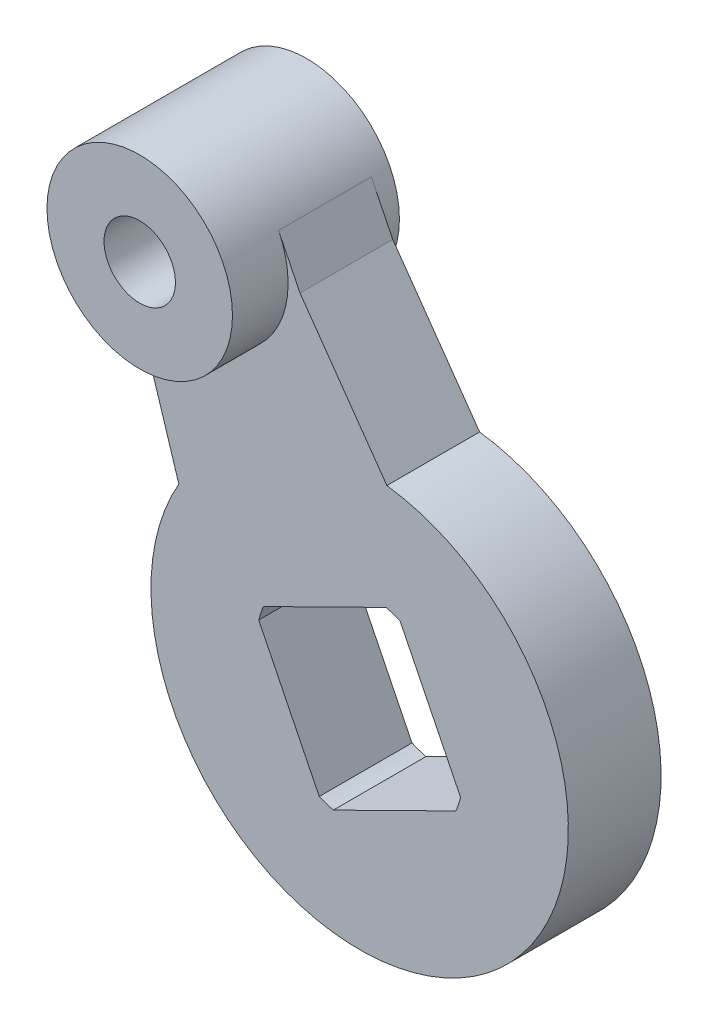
ISO-10303-21;
HEADER;
FILE_DESCRIPTION(('STEP AP214'),'2;1');
FILE_NAME('part.step','',(''),(''),'','','');
FILE_SCHEMA(('AUTOMOTIVE_DESIGN { 1 0 10303 214 1 1 1 1 }'));
ENDSEC;
DATA;
#1=APPLICATION_CONTEXT('core data for automotive mechanical design processes');
#2=APPLICATION_PROTOCOL_DEFINITION('international standard','automotive_design',2000,#1);
#3=PRODUCT_CONTEXT('',#1,'mechanical');
#4=PRODUCT('Part','Part','',(#3));
#5=PRODUCT_RELATED_PRODUCT_CATEGORY('part','',(#4));
#6=PRODUCT_DEFINITION_FORMATION('','',#4);
#7=PRODUCT_DEFINITION_CONTEXT('part definition',#1,'design');
#8=PRODUCT_DEFINITION('design','',#6,#7);
#9=PRODUCT_DEFINITION_SHAPE('','',#8);
#10=(LENGTH_UNIT() NAMED_UNIT(*) SI_UNIT(.MILLI.,.METRE.));
#11=(NAMED_UNIT(*) PLANE_ANGLE_UNIT() SI_UNIT($,.RADIAN.));
#12=(NAMED_UNIT(*) SI_UNIT($,.STERADIAN.) SOLID_ANGLE_UNIT());
#13=UNCERTAINTY_MEASURE_WITH_UNIT(LENGTH_MEASURE(1.E-05),#10,'distance_accuracy_value','');
#14=(GEOMETRIC_REPRESENTATION_CONTEXT(3) GLOBAL_UNCERTAINTY_ASSIGNED_CONTEXT((#13)) GLOBAL_UNIT_ASSIGNED_CONTEXT((#10,
#11,#12)) REPRESENTATION_CONTEXT('',''));
#15=CARTESIAN_POINT('',(0.,0.,0.));
#16=DIRECTION('',(0.,0.,1.));
#17=DIRECTION('',(1.,0.,0.));
#18=AXIS2_PLACEMENT_3D('',#15,#16,#17);
#19=CARTESIAN_POINT('',(-1.771236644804,3.586463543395,-0.6));
#20=DIRECTION('',(0.,0.,-1.));
#21=DIRECTION('',(-1.,0.,0.));
#22=AXIS2_PLACEMENT_3D('',#19,#20,#21);
#23=CYLINDRICAL_SURFACE('',#22,0.385000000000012);
#24=CARTESIAN_POINT('',(-1.771236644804,3.586463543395,-2.4));
#25=DIRECTION('',(0.,0.,-1.));
#26=DIRECTION('',(-1.,0.,0.));
#27=AXIS2_PLACEMENT_3D('',#24,#25,#26);
#28=CIRCLE('',#27,0.385000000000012);
#29=CARTESIAN_POINT('',(-2.15623664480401,3.586463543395,-2.4));
#30=VERTEX_POINT('',#29);
#31=EDGE_CURVE('E20',#30,#30,#28,.T.);
#32=ORIENTED_EDGE('',*,*,#31,.T.);
#33=EDGE_LOOP('',(#32));
#34=FACE_BOUND('',#33,.T.);
#35=CARTESIAN_POINT('',(-1.771236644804,3.586463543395,-0.6));
#36=DIRECTION('',(0.,0.,-1.));
#37=DIRECTION('',(-1.,0.,0.));
#38=AXIS2_PLACEMENT_3D('',#35,#36,#37);
#39=CIRCLE('',#38,0.385000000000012);
#40=CARTESIAN_POINT('',(-2.15623664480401,3.586463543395,-0.6));
#41=VERTEX_POINT('',#40);
#42=EDGE_CURVE('E235',#41,#41,#39,.F.);
#43=ORIENTED_EDGE('',*,*,#42,.T.);
#44=EDGE_LOOP('',(#43));
#45=FACE_BOUND('',#44,.T.);
#46=ADVANCED_FACE('F16',(#34,#45),#23,.F.);
#47=CARTESIAN_POINT('',(-1.528404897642,1.920448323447,-2.6));
#48=DIRECTION('',(0.,0.,1.));
#49=DIRECTION('',(0.442809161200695,-0.896615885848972,0.));
#50=AXIS2_PLACEMENT_3D('',#47,#48,#49);
#51=PLANE('',#50);
#52=CARTESIAN_POINT('',(0.,0.,-2.6));
#53=DIRECTION('',(0.,0.,1.));
#54=DIRECTION('',(1.,0.,0.));
#55=AXIS2_PLACEMENT_3D('',#52,#53,#54);
#56=CIRCLE('',#55,1.30000000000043);
#57=CARTESIAN_POINT('',(-0.0830630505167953,1.29734364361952,-2.6));
#58=VERTEX_POINT('',#57);
#59=CARTESIAN_POINT('',(-0.979678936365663,0.85453448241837,-2.6));
#60=VERTEX_POINT('',#59);
#61=EDGE_CURVE('E231',#58,#60,#56,.T.);
#62=ORIENTED_EDGE('',*,*,#61,.T.);
#63=DIRECTION('',(0.442809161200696,-0.896615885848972,0.));
#64=VECTOR('',#63,1.);
#65=CARTESIAN_POINT('',(-1.2398718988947,1.3813825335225,-2.6));
#66=LINE('',#65,#64);
#67=CARTESIAN_POINT('',(-1.50006486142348,1.9082305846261,-2.6));
#68=VERTEX_POINT('',#67);
#69=EDGE_CURVE('E169',#60,#68,#66,.F.);
#70=ORIENTED_EDGE('',*,*,#69,.T.);
#71=CARTESIAN_POINT('',(-1.771236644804,3.586463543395,-2.6));
#72=DIRECTION('',(0.,0.,1.));
#73=DIRECTION('',(1.,0.,0.));
#74=AXIS2_PLACEMENT_3D('',#71,#72,#73);
#75=CIRCLE('',#74,1.70000000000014);
#76=CARTESIAN_POINT('',(-0.603448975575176,2.35103974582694,-2.6));
#77=VERTEX_POINT('',#76);
#78=EDGE_CURVE('E234',#68,#77,#75,.T.);
#79=ORIENTED_EDGE('',*,*,#78,.T.);
#80=DIRECTION('',(-0.442809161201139,0.896615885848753,0.));
#81=VECTOR('',#80,1.);
#82=CARTESIAN_POINT('',(-0.34325601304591,1.824191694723,-2.6));
#83=LINE('',#82,#81);
#84=EDGE_CURVE('E178',#77,#58,#83,.F.);
#85=ORIENTED_EDGE('',*,*,#84,.T.);
#86=EDGE_LOOP('',(#62,#70,#79,#85));
#87=FACE_BOUND('',#86,.T.);
#88=ADVANCED_FACE('F247',(#87),#51,.F.);
#89=CARTESIAN_POINT('',(-0.3770742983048,3.115077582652,-2.4));
#90=DIRECTION('',(0.,0.,1.));
#91=DIRECTION('',(-0.442809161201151,0.896615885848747,0.));
#92=AXIS2_PLACEMENT_3D('',#89,#90,#91);
#93=PLANE('',#92);
#94=ORIENTED_EDGE('',*,*,#31,.F.);
#95=EDGE_LOOP('',(#94));
#96=FACE_BOUND('',#95,.T.);
#97=CARTESIAN_POINT('',(-1.771236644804,3.586463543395,-2.4));
#98=DIRECTION('',(0.,0.,1.));
#99=DIRECTION('',(1.,0.,0.));
#100=AXIS2_PLACEMENT_3D('',#97,#98,#99);
#101=CIRCLE('',#100,1.00000000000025);
#102=CARTESIAN_POINT('',(-0.77123664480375,3.586463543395,-2.4));
#103=VERTEX_POINT('',#102);
#104=EDGE_CURVE('E164',#103,#103,#101,.F.);
#105=ORIENTED_EDGE('',*,*,#104,.T.);
#106=EDGE_LOOP('',(#105));
#107=FACE_BOUND('',#106,.T.);
#108=ADVANCED_FACE('F243',(#96,#107),#93,.F.);
#109=CARTESIAN_POINT('',(-0.3770742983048,3.115077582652,-0.6));
#110=DIRECTION('',(0.,0.,1.));
#111=DIRECTION('',(-0.442809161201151,0.896615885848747,0.));
#112=AXIS2_PLACEMENT_3D('',#109,#110,#111);
#113=PLANE('',#112);
#114=ORIENTED_EDGE('',*,*,#42,.F.);
#115=EDGE_LOOP('',(#114));
#116=FACE_BOUND('',#115,.T.);
#117=CARTESIAN_POINT('',(-1.771236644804,3.586463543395,-0.6));
#118=DIRECTION('',(0.,0.,1.));
#119=DIRECTION('',(1.,0.,0.));
#120=AXIS2_PLACEMENT_3D('',#117,#118,#119);
#121=CIRCLE('',#120,1.00000000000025);
#122=CARTESIAN_POINT('',(-0.77123664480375,3.586463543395,-0.6));
#123=VERTEX_POINT('',#122);
#124=EDGE_CURVE('E163',#123,#123,#121,.T.);
#125=ORIENTED_EDGE('',*,*,#124,.T.);
#126=EDGE_LOOP('',(#125));
#127=FACE_BOUND('',#126,.T.);
#128=ADVANCED_FACE('F246',(#116,#127),#113,.T.);
#129=CARTESIAN_POINT('',(-1.771236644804,3.586463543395,-2.6));
#130=DIRECTION('',(0.,0.,1.));
#131=DIRECTION('',(1.,0.,0.));
#132=AXIS2_PLACEMENT_3D('',#129,#130,#131);
#133=CYLINDRICAL_SURFACE('',#132,1.70000000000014);
#134=DIRECTION('',(0.,0.,-1.));
#135=VECTOR('',#134,1.);
#136=CARTESIAN_POINT('',(-1.50006486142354,1.90823058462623,-2.4));
#137=LINE('',#136,#135);
#138=CARTESIAN_POINT('',(-1.50006486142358,1.90823058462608,-2.2));
#139=VERTEX_POINT('',#138);
#140=EDGE_CURVE('E233',#68,#139,#137,.F.);
#141=ORIENTED_EDGE('',*,*,#140,.T.);
#142=CARTESIAN_POINT('',(-1.771236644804,3.586463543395,-2.2));
#143=DIRECTION('',(0.,0.,1.));
#144=DIRECTION('',(1.,0.,0.));
#145=AXIS2_PLACEMENT_3D('',#142,#143,#144);
#146=CIRCLE('',#145,1.70000000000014);
#147=CARTESIAN_POINT('',(-0.603448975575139,2.35103974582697,-2.2));
#148=VERTEX_POINT('',#147);
#149=EDGE_CURVE('E150',#139,#148,#146,.T.);
#150=ORIENTED_EDGE('',*,*,#149,.T.);
#151=DIRECTION('',(0.,0.,1.));
#152=VECTOR('',#151,1.);
#153=CARTESIAN_POINT('',(-0.603448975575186,2.35103974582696,-2.4));
#154=LINE('',#153,#152);
#155=EDGE_CURVE('E173',#148,#77,#154,.F.);
#156=ORIENTED_EDGE('',*,*,#155,.T.);
#157=ORIENTED_EDGE('',*,*,#78,.F.);
#158=EDGE_LOOP('',(#141,#150,#156,#157));
#159=FACE_BOUND('',#158,.T.);
#160=ADVANCED_FACE('F361',(#159),#133,.F.);
#161=CARTESIAN_POINT('',(-0.07265533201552,1.276269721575,-2.610519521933));
#162=DIRECTION('',(0.896615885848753,0.442809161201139,0.));
#163=DIRECTION('',(-0.442809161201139,0.896615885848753,0.));
#164=AXIS2_PLACEMENT_3D('',#161,#162,#163);
#165=PLANE('',#164);
#166=DIRECTION('',(0.,0.,1.));
#167=VECTOR('',#166,1.);
#168=CARTESIAN_POINT('',(-0.0830630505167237,1.29734364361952,-2.4));
#169=LINE('',#168,#167);
#170=CARTESIAN_POINT('',(-0.0830630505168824,1.29734364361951,-2.2));
#171=VERTEX_POINT('',#170);
#172=EDGE_CURVE('E179',#171,#58,#169,.F.);
#173=ORIENTED_EDGE('',*,*,#172,.T.);
#174=ORIENTED_EDGE('',*,*,#84,.F.);
#175=ORIENTED_EDGE('',*,*,#155,.F.);
#176=DIRECTION('',(-0.442809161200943,0.89661588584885,0.));
#177=VECTOR('',#176,1.);
#178=CARTESIAN_POINT('',(0.061240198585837,1.00515324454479,-2.2));
#179=LINE('',#178,#177);
#180=EDGE_CURVE('E227',#148,#171,#179,.F.);
#181=ORIENTED_EDGE('',*,*,#180,.T.);
#182=EDGE_LOOP('',(#173,#174,#175,#181));
#183=FACE_BOUND('',#182,.T.);
#184=ADVANCED_FACE('F349',(#183),#165,.T.);
#185=CARTESIAN_POINT('',(0.,0.,-2.6));
#186=DIRECTION('',(0.,0.,1.));
#187=DIRECTION('',(1.,0.,0.));
#188=AXIS2_PLACEMENT_3D('',#185,#186,#187);
#189=CYLINDRICAL_SURFACE('',#188,1.30000000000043);
#190=ORIENTED_EDGE('',*,*,#172,.F.);
#191=CARTESIAN_POINT('',(0.,0.,-2.2));
#192=DIRECTION('',(0.,0.,1.));
#193=DIRECTION('',(1.,0.,0.));
#194=AXIS2_PLACEMENT_3D('',#191,#192,#193);
#195=CIRCLE('',#194,1.30000000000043);
#196=CARTESIAN_POINT('',(-0.979678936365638,0.854534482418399,-2.2));
#197=VERTEX_POINT('',#196);
#198=EDGE_CURVE('E224',#171,#197,#195,.T.);
#199=ORIENTED_EDGE('',*,*,#198,.T.);
#200=DIRECTION('',(0.,0.,1.));
#201=VECTOR('',#200,1.);
#202=CARTESIAN_POINT('',(-0.979678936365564,0.854534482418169,-2.4));
#203=LINE('',#202,#201);
#204=EDGE_CURVE('E177',#197,#60,#203,.F.);
#205=ORIENTED_EDGE('',*,*,#204,.T.);
#206=ORIENTED_EDGE('',*,*,#61,.F.);
#207=EDGE_LOOP('',(#190,#199,#205,#206));
#208=FACE_BOUND('',#207,.T.);
#209=ADVANCED_FACE('F262',(#208),#189,.F.);
#210=CARTESIAN_POINT('',(-1.510472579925,1.929304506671,-2.610519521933));
#211=DIRECTION('',(-0.896615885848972,-0.442809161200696,0.));
#212=DIRECTION('',(0.442809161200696,-0.896615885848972,0.));
#213=AXIS2_PLACEMENT_3D('',#210,#211,#212);
#214=PLANE('',#213);
#215=ORIENTED_EDGE('',*,*,#204,.F.);
#216=DIRECTION('',(0.442809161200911,-0.896615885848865,0.));
#217=VECTOR('',#216,1.);
#218=CARTESIAN_POINT('',(-0.835375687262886,0.562344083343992,-2.2));
#219=LINE('',#218,#217);
#220=EDGE_CURVE('E223',#197,#139,#219,.F.);
#221=ORIENTED_EDGE('',*,*,#220,.T.);
#222=ORIENTED_EDGE('',*,*,#140,.F.);
#223=ORIENTED_EDGE('',*,*,#69,.F.);
#224=EDGE_LOOP('',(#215,#221,#222,#223));
#225=FACE_BOUND('',#224,.T.);
#226=ADVANCED_FACE('F252',(#225),#214,.T.);
#227=CARTESIAN_POINT('',(-1.771236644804,3.586463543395,-2.4));
#228=DIRECTION('',(0.,0.,1.));
#229=DIRECTION('',(1.,0.,0.));
#230=AXIS2_PLACEMENT_3D('',#227,#228,#229);
#231=CYLINDRICAL_SURFACE('',#230,1.00000000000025);
#232=ORIENTED_EDGE('',*,*,#104,.F.);
#233=EDGE_LOOP('',(#232));
#234=FACE_BOUND('',#233,.T.);
#235=DIRECTION('',(0.,0.,1.));
#236=VECTOR('',#235,1.);
#237=CARTESIAN_POINT('',(-0.8746207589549,4.029272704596,-1.5));
#238=LINE('',#237,#236);
#239=CARTESIAN_POINT('',(-0.874620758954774,4.029272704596,-2.2));
#240=VERTEX_POINT('',#239);
#241=CARTESIAN_POINT('',(-0.874620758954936,4.02927270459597,-1.2));
#242=VERTEX_POINT('',#241);
#243=EDGE_CURVE('E156',#240,#242,#238,.T.);
#244=ORIENTED_EDGE('',*,*,#243,.F.);
#245=CARTESIAN_POINT('',(-1.771236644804,3.586463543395,-2.2));
#246=DIRECTION('',(0.,0.,1.));
#247=DIRECTION('',(1.,0.,0.));
#248=AXIS2_PLACEMENT_3D('',#245,#246,#247);
#249=CIRCLE('',#248,1.00000000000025);
#250=CARTESIAN_POINT('',(-2.66785253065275,3.14365438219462,-2.2));
#251=VERTEX_POINT('',#250);
#252=EDGE_CURVE('E143',#240,#251,#249,.F.);
#253=ORIENTED_EDGE('',*,*,#252,.T.);
#254=DIRECTION('',(0.,0.,-1.));
#255=VECTOR('',#254,1.);
#256=CARTESIAN_POINT('',(-2.66785253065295,3.14365438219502,-1.7));
#257=LINE('',#256,#255);
#258=CARTESIAN_POINT('',(-2.66785253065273,3.14365438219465,-1.2));
#259=VERTEX_POINT('',#258);
#260=EDGE_CURVE('E311',#251,#259,#257,.F.);
#261=ORIENTED_EDGE('',*,*,#260,.T.);
#262=CARTESIAN_POINT('',(-1.771236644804,3.586463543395,-1.2));
#263=DIRECTION('',(0.,0.,1.));
#264=DIRECTION('',(1.,0.,0.));
#265=AXIS2_PLACEMENT_3D('',#262,#263,#264);
#266=CIRCLE('',#265,1.00000000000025);
#267=EDGE_CURVE('E136',#242,#259,#266,.F.);
#268=ORIENTED_EDGE('',*,*,#267,.F.);
#269=EDGE_LOOP('',(#244,#253,#261,#268));
#270=FACE_BOUND('',#269,.T.);
#271=ORIENTED_EDGE('',*,*,#124,.F.);
#272=EDGE_LOOP('',(#271));
#273=FACE_BOUND('',#272,.T.);
#274=ADVANCED_FACE('F161',(#234,#270,#273),#231,.T.);
#275=CARTESIAN_POINT('',(-3.925158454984,2.662164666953,-2.2));
#276=DIRECTION('',(0.,0.,-1.));
#277=DIRECTION('',(0.896615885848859,0.442809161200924,0.));
#278=AXIS2_PLACEMENT_3D('',#275,#276,#277);
#279=PLANE('',#278);
#280=DIRECTION('',(0.442809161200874,-0.896615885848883,0.));
#281=VECTOR('',#280,1.);
#282=CARTESIAN_POINT('',(-0.76212350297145,-0.37638778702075,-2.2));
#283=LINE('',#282,#281);
#284=CARTESIAN_POINT('',(-1.08846063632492,0.284391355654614,-2.2));
#285=VERTEX_POINT('',#284);
#286=CARTESIAN_POINT('',(-0.435786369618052,-1.03716692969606,-2.2));
#287=VERTEX_POINT('',#286);
#288=EDGE_CURVE('E302',#285,#287,#283,.T.);
#289=ORIENTED_EDGE('',*,*,#288,.T.);
#290=CARTESIAN_POINT('',(0.,0.,-2.2));
#291=DIRECTION('',(0.,0.,-1.));
#292=DIRECTION('',(-1.,0.,0.));
#293=AXIS2_PLACEMENT_3D('',#290,#291,#292);
#294=CIRCLE('',#293,1.12500000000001);
#295=CARTESIAN_POINT('',(-0.284391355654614,-1.08846063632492,-2.2));
#296=VERTEX_POINT('',#295);
#297=EDGE_CURVE('E208',#287,#296,#294,.F.);
#298=ORIENTED_EDGE('',*,*,#297,.T.);
#299=DIRECTION('',(0.896615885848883,0.442809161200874,0.));
#300=VECTOR('',#299,1.);
#301=CARTESIAN_POINT('',(0.37638778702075,-0.76212350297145,-2.2));
#302=LINE('',#301,#300);
#303=CARTESIAN_POINT('',(1.03716692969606,-0.435786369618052,-2.2));
#304=VERTEX_POINT('',#303);
#305=EDGE_CURVE('E297',#296,#304,#302,.T.);
#306=ORIENTED_EDGE('',*,*,#305,.T.);
#307=CARTESIAN_POINT('',(0.,0.,-2.2));
#308=DIRECTION('',(0.,0.,-1.));
#309=DIRECTION('',(-1.,0.,0.));
#310=AXIS2_PLACEMENT_3D('',#307,#308,#309);
#311=CIRCLE('',#310,1.12500000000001);
#312=CARTESIAN_POINT('',(1.08846063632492,-0.284391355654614,-2.2));
#313=VERTEX_POINT('',#312);
#314=EDGE_CURVE('E204',#304,#313,#311,.F.);
#315=ORIENTED_EDGE('',*,*,#314,.T.);
#316=DIRECTION('',(-0.442809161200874,0.896615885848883,0.));
#317=VECTOR('',#316,1.);
#318=CARTESIAN_POINT('',(0.76212350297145,0.37638778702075,-2.2));
#319=LINE('',#318,#317);
#320=CARTESIAN_POINT('',(0.435786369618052,1.03716692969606,-2.2));
#321=VERTEX_POINT('',#320);
#322=EDGE_CURVE('E292',#313,#321,#319,.T.);
#323=ORIENTED_EDGE('',*,*,#322,.T.);
#324=CARTESIAN_POINT('',(0.,0.,-2.2));
#325=DIRECTION('',(0.,0.,-1.));
#326=DIRECTION('',(-1.,0.,0.));
#327=AXIS2_PLACEMENT_3D('',#324,#325,#326);
#328=CIRCLE('',#327,1.12500000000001);
#329=CARTESIAN_POINT('',(0.284391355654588,1.08846063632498,-2.2));
#330=VERTEX_POINT('',#329);
#331=EDGE_CURVE('E220',#330,#321,#328,.T.);
#332=ORIENTED_EDGE('',*,*,#331,.F.);
#333=DIRECTION('',(-0.896615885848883,-0.442809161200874,0.));
#334=VECTOR('',#333,1.);
#335=CARTESIAN_POINT('',(-0.37638778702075,0.76212350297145,-2.2));
#336=LINE('',#335,#334);
#337=CARTESIAN_POINT('',(-1.03716692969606,0.435786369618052,-2.2));
#338=VERTEX_POINT('',#337);
#339=EDGE_CURVE('E307',#330,#338,#336,.T.);
#340=ORIENTED_EDGE('',*,*,#339,.T.);
#341=CARTESIAN_POINT('',(0.,0.,-2.2));
#342=DIRECTION('',(0.,0.,-1.));
#343=DIRECTION('',(-1.,0.,0.));
#344=AXIS2_PLACEMENT_3D('',#341,#342,#343);
#345=CIRCLE('',#344,1.12500000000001);
#346=EDGE_CURVE('E212',#338,#285,#345,.F.);
#347=ORIENTED_EDGE('',*,*,#346,.T.);
#348=EDGE_LOOP('',(#289,#298,#306,#315,#323,#332,#340,#347));
#349=FACE_BOUND('',#348,.T.);
#350=ORIENTED_EDGE('',*,*,#198,.F.);
#351=ORIENTED_EDGE('',*,*,#180,.F.);
#352=ORIENTED_EDGE('',*,*,#149,.F.);
#353=ORIENTED_EDGE('',*,*,#220,.F.);
#354=EDGE_LOOP('',(#350,#351,#352,#353));
#355=FACE_BOUND('',#354,.T.);
#356=ORIENTED_EDGE('',*,*,#252,.F.);
#357=DIRECTION('',(-0.442809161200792,0.896615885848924,0.));
#358=VECTOR('',#357,1.);
#359=CARTESIAN_POINT('',(-0.75884115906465,3.794838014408,-2.2));
#360=LINE('',#359,#358);
#361=CARTESIAN_POINT('',(-0.643061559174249,3.56040332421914,-2.2));
#362=VERTEX_POINT('',#361);
#363=EDGE_CURVE('E146',#240,#362,#360,.F.);
#364=ORIENTED_EDGE('',*,*,#363,.T.);
#365=DIRECTION('',(-0.575817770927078,0.817578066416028,0.));
#366=VECTOR('',#365,1.);
#367=CARTESIAN_POINT('',(-0.174840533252,2.895597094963,-2.2));
#368=LINE('',#367,#366);
#369=CARTESIAN_POINT('',(0.293380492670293,2.23079086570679,-2.2));
#370=VERTEX_POINT('',#369);
#371=EDGE_CURVE('E222',#362,#370,#368,.F.);
#372=ORIENTED_EDGE('',*,*,#371,.T.);
#373=CARTESIAN_POINT('',(0.,0.,-2.2));
#374=DIRECTION('',(0.,0.,-1.));
#375=DIRECTION('',(-1.,0.,0.));
#376=AXIS2_PLACEMENT_3D('',#373,#374,#375);
#377=CIRCLE('',#376,2.25000000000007);
#378=CARTESIAN_POINT('',(-1.94970900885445,1.12300257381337,-2.2));
#379=VERTEX_POINT('',#378);
#380=EDGE_CURVE('E216',#370,#379,#377,.T.);
#381=ORIENTED_EDGE('',*,*,#380,.T.);
#382=DIRECTION('',(0.299200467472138,-0.954190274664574,0.));
#383=VECTOR('',#382,1.);
#384=CARTESIAN_POINT('',(-2.1930011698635,1.8988937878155,-2.2));
#385=LINE('',#384,#383);
#386=CARTESIAN_POINT('',(-2.43629333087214,2.67478500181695,-2.2));
#387=VERTEX_POINT('',#386);
#388=EDGE_CURVE('E314',#379,#387,#385,.F.);
#389=ORIENTED_EDGE('',*,*,#388,.T.);
#390=DIRECTION('',(0.442809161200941,-0.896615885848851,0.));
#391=VECTOR('',#390,1.);
#392=CARTESIAN_POINT('',(-2.5520729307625,2.909219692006,-2.2));
#393=LINE('',#392,#391);
#394=EDGE_CURVE('E149',#387,#251,#393,.F.);
#395=ORIENTED_EDGE('',*,*,#394,.T.);
#396=EDGE_LOOP('',(#356,#364,#372,#381,#389,#395));
#397=FACE_BOUND('',#396,.T.);
#398=ADVANCED_FACE('F145',(#349,#355,#397),#279,.T.);
#399=CARTESIAN_POINT('',(-0.6617904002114,3.58699557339,-2.22));
#400=DIRECTION('',(0.817578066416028,0.575817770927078,0.));
#401=DIRECTION('',(0.,0.,1.));
#402=AXIS2_PLACEMENT_3D('',#399,#400,#401);
#403=PLANE('',#402);
#404=DIRECTION('',(0.,0.,-1.));
#405=VECTOR('',#404,1.);
#406=CARTESIAN_POINT('',(-0.643061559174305,3.5604033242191,-1.7));
#407=LINE('',#406,#405);
#408=CARTESIAN_POINT('',(-0.643061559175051,3.56040332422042,-1.2));
#409=VERTEX_POINT('',#408);
#410=EDGE_CURVE('E159',#362,#409,#407,.F.);
#411=ORIENTED_EDGE('',*,*,#410,.T.);
#412=DIRECTION('',(0.575817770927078,-0.817578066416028,0.));
#413=VECTOR('',#412,1.);
#414=CARTESIAN_POINT('',(-0.6617904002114,3.58699557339,-1.2));
#415=LINE('',#414,#413);
#416=CARTESIAN_POINT('',(0.293380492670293,2.23079086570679,-1.2));
#417=VERTEX_POINT('',#416);
#418=EDGE_CURVE('E200',#409,#417,#415,.T.);
#419=ORIENTED_EDGE('',*,*,#418,.T.);
#420=DIRECTION('',(0.,0.,-1.));
#421=VECTOR('',#420,1.);
#422=CARTESIAN_POINT('',(0.293380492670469,2.23079086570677,-1.7));
#423=LINE('',#422,#421);
#424=EDGE_CURVE('E219',#417,#370,#423,.T.);
#425=ORIENTED_EDGE('',*,*,#424,.T.);
#426=ORIENTED_EDGE('',*,*,#371,.F.);
#427=EDGE_LOOP('',(#411,#419,#425,#426));
#428=FACE_BOUND('',#427,.T.);
#429=ADVANCED_FACE('F259',(#428),#403,.T.);
#430=CARTESIAN_POINT('',(0.,0.,-1.2));
#431=DIRECTION('',(0.,0.,-1.));
#432=DIRECTION('',(-1.,0.,0.));
#433=AXIS2_PLACEMENT_3D('',#430,#431,#432);
#434=CYLINDRICAL_SURFACE('',#433,2.25000000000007);
#435=DIRECTION('',(0.,0.,1.));
#436=VECTOR('',#435,1.);
#437=CARTESIAN_POINT('',(-1.94970900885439,1.12300257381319,-1.7));
#438=LINE('',#437,#436);
#439=CARTESIAN_POINT('',(-1.94970900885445,1.12300257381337,-1.2));
#440=VERTEX_POINT('',#439);
#441=EDGE_CURVE('E218',#440,#379,#438,.F.);
#442=ORIENTED_EDGE('',*,*,#441,.T.);
#443=ORIENTED_EDGE('',*,*,#380,.F.);
#444=ORIENTED_EDGE('',*,*,#424,.F.);
#445=CARTESIAN_POINT('',(0.,0.,-1.2));
#446=DIRECTION('',(0.,0.,-1.));
#447=DIRECTION('',(-1.,0.,0.));
#448=AXIS2_PLACEMENT_3D('',#445,#446,#447);
#449=CIRCLE('',#448,2.25000000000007);
#450=EDGE_CURVE('E197',#417,#440,#449,.T.);
#451=ORIENTED_EDGE('',*,*,#450,.T.);
#452=EDGE_LOOP('',(#442,#443,#444,#451));
#453=FACE_BOUND('',#452,.T.);
#454=ADVANCED_FACE('F378',(#453),#434,.T.);
#455=CARTESIAN_POINT('',(-1.939977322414,1.091966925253,-2.22));
#456=DIRECTION('',(-0.954190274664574,-0.299200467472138,0.));
#457=DIRECTION('',(0.,0.,1.));
#458=AXIS2_PLACEMENT_3D('',#455,#456,#457);
#459=PLANE('',#458);
#460=DIRECTION('',(0.,0.,1.));
#461=VECTOR('',#460,1.);
#462=CARTESIAN_POINT('',(-2.43629333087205,2.67478500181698,-1.7));
#463=LINE('',#462,#461);
#464=CARTESIAN_POINT('',(-2.43629333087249,2.67478500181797,-1.2));
#465=VERTEX_POINT('',#464);
#466=EDGE_CURVE('E313',#465,#387,#463,.F.);
#467=ORIENTED_EDGE('',*,*,#466,.T.);
#468=ORIENTED_EDGE('',*,*,#388,.F.);
#469=ORIENTED_EDGE('',*,*,#441,.F.);
#470=DIRECTION('',(-0.299200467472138,0.954190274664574,0.));
#471=VECTOR('',#470,1.);
#472=CARTESIAN_POINT('',(-1.939977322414,1.091966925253,-1.2));
#473=LINE('',#472,#471);
#474=EDGE_CURVE('E193',#440,#465,#473,.T.);
#475=ORIENTED_EDGE('',*,*,#474,.T.);
#476=EDGE_LOOP('',(#467,#468,#469,#475));
#477=FACE_BOUND('',#476,.T.);
#478=ADVANCED_FACE('F380',(#477),#459,.T.);
#479=CARTESIAN_POINT('',(-2.672510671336,3.153086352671,-2.22));
#480=DIRECTION('',(-0.896615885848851,-0.442809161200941,0.));
#481=DIRECTION('',(0.442809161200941,-0.896615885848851,0.));
#482=AXIS2_PLACEMENT_3D('',#479,#480,#481);
#483=PLANE('',#482);
#484=ORIENTED_EDGE('',*,*,#466,.F.);
#485=DIRECTION('',(-0.442809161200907,0.896615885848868,0.));
#486=VECTOR('',#485,1.);
#487=CARTESIAN_POINT('',(-1.28368998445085,0.340952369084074,-1.2));
#488=LINE('',#487,#486);
#489=EDGE_CURVE('E196',#465,#259,#488,.T.);
#490=ORIENTED_EDGE('',*,*,#489,.T.);
#491=ORIENTED_EDGE('',*,*,#260,.F.);
#492=ORIENTED_EDGE('',*,*,#394,.F.);
#493=EDGE_LOOP('',(#484,#490,#491,#492));
#494=FACE_BOUND('',#493,.T.);
#495=ADVANCED_FACE('F383',(#494),#483,.T.);
#496=CARTESIAN_POINT('',(-0.6384034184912,3.550971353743,-2.22));
#497=DIRECTION('',(0.896615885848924,0.442809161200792,0.));
#498=DIRECTION('',(-0.442809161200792,0.896615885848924,0.));
#499=AXIS2_PLACEMENT_3D('',#496,#497,#498);
#500=PLANE('',#499);
#501=ORIENTED_EDGE('',*,*,#410,.F.);
#502=ORIENTED_EDGE('',*,*,#363,.F.);
#503=ORIENTED_EDGE('',*,*,#243,.T.);
#504=DIRECTION('',(0.442809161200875,-0.896615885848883,0.));
#505=VECTOR('',#504,1.);
#506=CARTESIAN_POINT('',(0.509541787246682,1.2265706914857,-1.2));
#507=LINE('',#506,#505);
#508=EDGE_CURVE('E279',#242,#409,#507,.T.);
#509=ORIENTED_EDGE('',*,*,#508,.T.);
#510=EDGE_LOOP('',(#501,#502,#503,#509));
#511=FACE_BOUND('',#510,.T.);
#512=ADVANCED_FACE('F154',(#511),#500,.T.);
#513=CARTESIAN_POINT('',(-1.063598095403,0.4227328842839,-1.18));
#514=DIRECTION('',(-0.442809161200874,0.896615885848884,0.));
#515=DIRECTION('',(0.896615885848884,0.442809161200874,0.));
#516=AXIS2_PLACEMENT_3D('',#513,#514,#515);
#517=PLANE('',#516);
#518=ORIENTED_EDGE('',*,*,#339,.F.);
#519=DIRECTION('',(0.,0.,-1.));
#520=VECTOR('',#519,1.);
#521=CARTESIAN_POINT('',(0.2843913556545,1.088460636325,-1.7));
#522=LINE('',#521,#520);
#523=CARTESIAN_POINT('',(0.284391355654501,1.088460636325,-1.2));
#524=VERTEX_POINT('',#523);
#525=EDGE_CURVE('E203',#330,#524,#522,.F.);
#526=ORIENTED_EDGE('',*,*,#525,.T.);
#527=DIRECTION('',(-0.896615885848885,-0.442809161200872,0.));
#528=VECTOR('',#527,1.);
#529=CARTESIAN_POINT('',(-0.376387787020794,0.762123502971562,-1.2));
#530=LINE('',#529,#528);
#531=CARTESIAN_POINT('',(-1.03716692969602,0.435786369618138,-1.2));
#532=VERTEX_POINT('',#531);
#533=EDGE_CURVE('E192',#524,#532,#530,.T.);
#534=ORIENTED_EDGE('',*,*,#533,.T.);
#535=DIRECTION('',(0.,0.,1.));
#536=VECTOR('',#535,1.);
#537=CARTESIAN_POINT('',(-1.03716692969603,0.435786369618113,-1.7));
#538=LINE('',#537,#536);
#539=EDGE_CURVE('E215',#532,#338,#538,.F.);
#540=ORIENTED_EDGE('',*,*,#539,.T.);
#541=EDGE_LOOP('',(#518,#526,#534,#540));
#542=FACE_BOUND('',#541,.T.);
#543=ADVANCED_FACE('F390',(#542),#517,.F.);
#544=CARTESIAN_POINT('',(0.,0.,-1.2));
#545=DIRECTION('',(0.,0.,-1.));
#546=DIRECTION('',(-1.,0.,0.));
#547=AXIS2_PLACEMENT_3D('',#544,#545,#546);
#548=CYLINDRICAL_SURFACE('',#547,1.12500000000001);
#549=ORIENTED_EDGE('',*,*,#346,.F.);
#550=ORIENTED_EDGE('',*,*,#539,.F.);
#551=CARTESIAN_POINT('',(0.,0.,-1.2));
#552=DIRECTION('',(0.,0.,-1.));
#553=DIRECTION('',(-1.,0.,0.));
#554=AXIS2_PLACEMENT_3D('',#551,#552,#553);
#555=CIRCLE('',#554,1.12500000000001);
#556=CARTESIAN_POINT('',(-1.08846063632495,0.284391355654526,-1.2));
#557=VERTEX_POINT('',#556);
#558=EDGE_CURVE('E189',#532,#557,#555,.F.);
#559=ORIENTED_EDGE('',*,*,#558,.T.);
#560=DIRECTION('',(0.,0.,-1.));
#561=VECTOR('',#560,1.);
#562=CARTESIAN_POINT('',(-1.08846063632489,0.284391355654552,-1.7));
#563=LINE('',#562,#561);
#564=EDGE_CURVE('E214',#557,#285,#563,.T.);
#565=ORIENTED_EDGE('',*,*,#564,.T.);
#566=EDGE_LOOP('',(#549,#550,#559,#565));
#567=FACE_BOUND('',#566,.T.);
#568=ADVANCED_FACE('F393',(#567),#548,.F.);
#569=CARTESIAN_POINT('',(-0.4227328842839,-1.063598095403,-1.18));
#570=DIRECTION('',(-0.896615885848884,-0.442809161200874,0.));
#571=DIRECTION('',(-0.442809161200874,0.896615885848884,0.));
#572=AXIS2_PLACEMENT_3D('',#569,#570,#571);
#573=PLANE('',#572);
#574=ORIENTED_EDGE('',*,*,#288,.F.);
#575=ORIENTED_EDGE('',*,*,#564,.F.);
#576=DIRECTION('',(0.442809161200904,-0.896615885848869,0.));
#577=VECTOR('',#576,1.);
#578=CARTESIAN_POINT('',(-1.1491976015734,0.407373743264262,-1.2));
#579=LINE('',#578,#577);
#580=CARTESIAN_POINT('',(-0.4357863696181,-1.03716692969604,-1.2));
#581=VERTEX_POINT('',#580);
#582=EDGE_CURVE('E188',#557,#581,#579,.T.);
#583=ORIENTED_EDGE('',*,*,#582,.T.);
#584=DIRECTION('',(0.,0.,1.));
#585=VECTOR('',#584,1.);
#586=CARTESIAN_POINT('',(-0.435786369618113,-1.03716692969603,-1.7));
#587=LINE('',#586,#585);
#588=EDGE_CURVE('E211',#581,#287,#587,.F.);
#589=ORIENTED_EDGE('',*,*,#588,.T.);
#590=EDGE_LOOP('',(#574,#575,#583,#589));
#591=FACE_BOUND('',#590,.T.);
#592=ADVANCED_FACE('F395',(#591),#573,.F.);
#593=CARTESIAN_POINT('',(0.,0.,-1.2));
#594=DIRECTION('',(0.,0.,-1.));
#595=DIRECTION('',(-1.,0.,0.));
#596=AXIS2_PLACEMENT_3D('',#593,#594,#595);
#597=CYLINDRICAL_SURFACE('',#596,1.12500000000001);
#598=ORIENTED_EDGE('',*,*,#297,.F.);
#599=ORIENTED_EDGE('',*,*,#588,.F.);
#600=CARTESIAN_POINT('',(0.,0.,-1.2));
#601=DIRECTION('',(0.,0.,-1.));
#602=DIRECTION('',(-1.,0.,0.));
#603=AXIS2_PLACEMENT_3D('',#600,#601,#602);
#604=CIRCLE('',#603,1.12500000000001);
#605=CARTESIAN_POINT('',(-0.284391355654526,-1.08846063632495,-1.2));
#606=VERTEX_POINT('',#605);
#607=EDGE_CURVE('E185',#581,#606,#604,.F.);
#608=ORIENTED_EDGE('',*,*,#607,.T.);
#609=DIRECTION('',(0.,0.,-1.));
#610=VECTOR('',#609,1.);
#611=CARTESIAN_POINT('',(-0.284391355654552,-1.08846063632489,-1.7));
#612=LINE('',#611,#610);
#613=EDGE_CURVE('E210',#606,#296,#612,.T.);
#614=ORIENTED_EDGE('',*,*,#613,.T.);
#615=EDGE_LOOP('',(#598,#599,#608,#614));
#616=FACE_BOUND('',#615,.T.);
#617=ADVANCED_FACE('F398',(#616),#597,.F.);
#618=CARTESIAN_POINT('',(1.063598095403,-0.4227328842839,-1.18));
#619=DIRECTION('',(0.442809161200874,-0.896615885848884,0.));
#620=DIRECTION('',(-0.896615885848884,-0.442809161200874,0.));
#621=AXIS2_PLACEMENT_3D('',#618,#619,#620);
#622=PLANE('',#621);
#623=ORIENTED_EDGE('',*,*,#305,.F.);
#624=ORIENTED_EDGE('',*,*,#613,.F.);
#625=DIRECTION('',(0.896615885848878,0.442809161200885,0.));
#626=VECTOR('',#625,1.);
#627=CARTESIAN_POINT('',(0.376387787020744,-0.762123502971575,-1.2));
#628=LINE('',#627,#626);
#629=CARTESIAN_POINT('',(1.03716692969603,-0.435786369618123,-1.2));
#630=VERTEX_POINT('',#629);
#631=EDGE_CURVE('E184',#606,#630,#628,.T.);
#632=ORIENTED_EDGE('',*,*,#631,.T.);
#633=DIRECTION('',(0.,0.,1.));
#634=VECTOR('',#633,1.);
#635=CARTESIAN_POINT('',(1.03716692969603,-0.435786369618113,-1.7));
#636=LINE('',#635,#634);
#637=EDGE_CURVE('E207',#630,#304,#636,.F.);
#638=ORIENTED_EDGE('',*,*,#637,.T.);
#639=EDGE_LOOP('',(#623,#624,#632,#638));
#640=FACE_BOUND('',#639,.T.);
#641=ADVANCED_FACE('F400',(#640),#622,.F.);
#642=CARTESIAN_POINT('',(0.,0.,-1.2));
#643=DIRECTION('',(0.,0.,-1.));
#644=DIRECTION('',(-1.,0.,0.));
#645=AXIS2_PLACEMENT_3D('',#642,#643,#644);
#646=CYLINDRICAL_SURFACE('',#645,1.12500000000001);
#647=ORIENTED_EDGE('',*,*,#314,.F.);
#648=ORIENTED_EDGE('',*,*,#637,.F.);
#649=CARTESIAN_POINT('',(0.,0.,-1.2));
#650=DIRECTION('',(0.,0.,-1.));
#651=DIRECTION('',(-1.,0.,0.));
#652=AXIS2_PLACEMENT_3D('',#649,#650,#651);
#653=CIRCLE('',#652,1.12500000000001);
#654=CARTESIAN_POINT('',(1.08846063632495,-0.284391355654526,-1.2));
#655=VERTEX_POINT('',#654);
#656=EDGE_CURVE('E181',#630,#655,#653,.F.);
#657=ORIENTED_EDGE('',*,*,#656,.T.);
#658=DIRECTION('',(0.,0.,-1.));
#659=VECTOR('',#658,1.);
#660=CARTESIAN_POINT('',(1.08846063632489,-0.284391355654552,-1.7));
#661=LINE('',#660,#659);
#662=EDGE_CURVE('E206',#655,#313,#661,.T.);
#663=ORIENTED_EDGE('',*,*,#662,.T.);
#664=EDGE_LOOP('',(#647,#648,#657,#663));
#665=FACE_BOUND('',#664,.T.);
#666=ADVANCED_FACE('F402',(#665),#646,.F.);
#667=CARTESIAN_POINT('',(0.4227328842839,1.063598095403,-1.18));
#668=DIRECTION('',(0.896615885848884,0.442809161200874,0.));
#669=DIRECTION('',(0.442809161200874,-0.896615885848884,0.));
#670=AXIS2_PLACEMENT_3D('',#667,#668,#669);
#671=PLANE('',#670);
#672=ORIENTED_EDGE('',*,*,#322,.F.);
#673=ORIENTED_EDGE('',*,*,#662,.F.);
#674=DIRECTION('',(-0.442809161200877,0.896615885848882,0.));
#675=VECTOR('',#674,1.);
#676=CARTESIAN_POINT('',(0.375049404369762,1.16014931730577,-1.2));
#677=LINE('',#676,#675);
#678=CARTESIAN_POINT('',(0.435786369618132,1.03716692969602,-1.2));
#679=VERTEX_POINT('',#678);
#680=EDGE_CURVE('E26',#655,#679,#677,.T.);
#681=ORIENTED_EDGE('',*,*,#680,.T.);
#682=DIRECTION('',(0.,0.,1.));
#683=VECTOR('',#682,1.);
#684=CARTESIAN_POINT('',(0.435786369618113,1.03716692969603,-1.7));
#685=LINE('',#684,#683);
#686=EDGE_CURVE('E34',#679,#321,#685,.F.);
#687=ORIENTED_EDGE('',*,*,#686,.T.);
#688=EDGE_LOOP('',(#672,#673,#681,#687));
#689=FACE_BOUND('',#688,.T.);
#690=ADVANCED_FACE('F273',(#689),#671,.F.);
#691=CARTESIAN_POINT('',(0.,0.,-1.2));
#692=DIRECTION('',(0.,0.,-1.));
#693=DIRECTION('',(-1.,0.,0.));
#694=AXIS2_PLACEMENT_3D('',#691,#692,#693);
#695=CYLINDRICAL_SURFACE('',#694,1.12500000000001);
#696=ORIENTED_EDGE('',*,*,#331,.T.);
#697=ORIENTED_EDGE('',*,*,#686,.F.);
#698=CARTESIAN_POINT('',(0.,0.,-1.2));
#699=DIRECTION('',(0.,0.,-1.));
#700=DIRECTION('',(-1.,0.,0.));
#701=AXIS2_PLACEMENT_3D('',#698,#699,#700);
#702=CIRCLE('',#701,1.12500000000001);
#703=EDGE_CURVE('E11',#679,#524,#702,.F.);
#704=ORIENTED_EDGE('',*,*,#703,.T.);
#705=ORIENTED_EDGE('',*,*,#525,.F.);
#706=EDGE_LOOP('',(#696,#697,#704,#705));
#707=FACE_BOUND('',#706,.T.);
#708=ADVANCED_FACE('F268',(#707),#695,.F.);
#709=CARTESIAN_POINT('',(-3.925171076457,2.662157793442,-1.2));
#710=DIRECTION('',(0.,0.,-1.));
#711=DIRECTION('',(0.896615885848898,0.442809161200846,0.));
#712=AXIS2_PLACEMENT_3D('',#709,#710,#711);
#713=PLANE('',#712);
#714=ORIENTED_EDGE('',*,*,#680,.F.);
#715=ORIENTED_EDGE('',*,*,#656,.F.);
#716=ORIENTED_EDGE('',*,*,#631,.F.);
#717=ORIENTED_EDGE('',*,*,#607,.F.);
#718=ORIENTED_EDGE('',*,*,#582,.F.);
#719=ORIENTED_EDGE('',*,*,#558,.F.);
#720=ORIENTED_EDGE('',*,*,#533,.F.);
#721=ORIENTED_EDGE('',*,*,#703,.F.);
#722=EDGE_LOOP('',(#714,#715,#716,#717,#718,#719,#720,#721));
#723=FACE_BOUND('',#722,.T.);
#724=ORIENTED_EDGE('',*,*,#508,.F.);
#725=ORIENTED_EDGE('',*,*,#267,.T.);
#726=ORIENTED_EDGE('',*,*,#489,.F.);
#727=ORIENTED_EDGE('',*,*,#474,.F.);
#728=ORIENTED_EDGE('',*,*,#450,.F.);
#729=ORIENTED_EDGE('',*,*,#418,.F.);
#730=EDGE_LOOP('',(#724,#725,#726,#727,#728,#729));
#731=FACE_BOUND('',#730,.T.);
#732=ADVANCED_FACE('F18',(#723,#731),#713,.F.);
#733=CLOSED_SHELL('',(#46,#88,#108,#128,#160,#184,#209,#226,#274,#398,#429,#454,#478,#495,#512,
#543,#568,#592,#617,#641,#666,#690,#708,#732));
#734=MANIFOLD_SOLID_BREP('B1',#733);
#735=ADVANCED_BREP_SHAPE_REPRESENTATION('',(#18,#734),#14);
#736=SHAPE_DEFINITION_REPRESENTATION(#9,#735);
ENDSEC;
END-ISO-10303-21;
